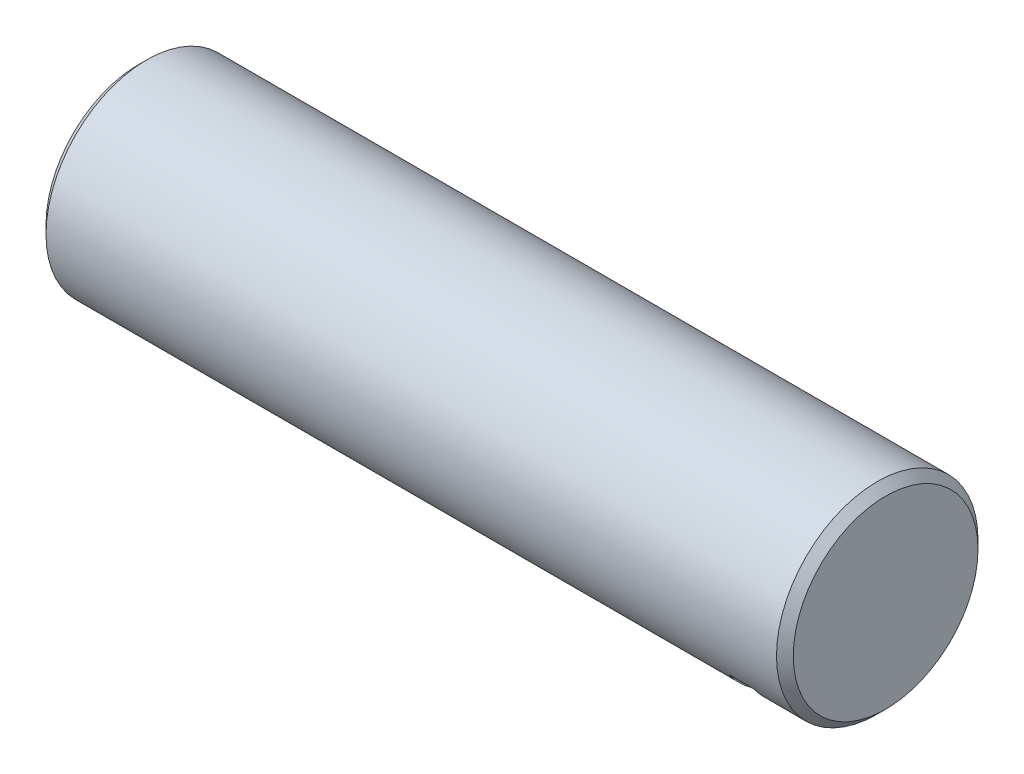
ISO-10303-21;
HEADER;
FILE_DESCRIPTION(('STEP AP214'),'2;1');
FILE_NAME('part.step','',(''),(''),'','','');
FILE_SCHEMA(('AUTOMOTIVE_DESIGN { 1 0 10303 214 1 1 1 1 }'));
ENDSEC;
DATA;
#1=APPLICATION_CONTEXT('core data for automotive mechanical design processes');
#2=APPLICATION_PROTOCOL_DEFINITION('international standard','automotive_design',2000,#1);
#3=PRODUCT_CONTEXT('',#1,'mechanical');
#4=PRODUCT('Part','Part','',(#3));
#5=PRODUCT_RELATED_PRODUCT_CATEGORY('part','',(#4));
#6=PRODUCT_DEFINITION_FORMATION('','',#4);
#7=PRODUCT_DEFINITION_CONTEXT('part definition',#1,'design');
#8=PRODUCT_DEFINITION('design','',#6,#7);
#9=PRODUCT_DEFINITION_SHAPE('','',#8);
#10=(LENGTH_UNIT() NAMED_UNIT(*) SI_UNIT(.MILLI.,.METRE.));
#11=(NAMED_UNIT(*) PLANE_ANGLE_UNIT() SI_UNIT($,.RADIAN.));
#12=(NAMED_UNIT(*) SI_UNIT($,.STERADIAN.) SOLID_ANGLE_UNIT());
#13=UNCERTAINTY_MEASURE_WITH_UNIT(LENGTH_MEASURE(1.E-05),#10,'distance_accuracy_value','');
#14=(GEOMETRIC_REPRESENTATION_CONTEXT(3) GLOBAL_UNCERTAINTY_ASSIGNED_CONTEXT((#13)) GLOBAL_UNIT_ASSIGNED_CONTEXT((#10,
#11,#12)) REPRESENTATION_CONTEXT('',''));
#15=CARTESIAN_POINT('',(0.,0.,0.));
#16=DIRECTION('',(0.,0.,1.));
#17=DIRECTION('',(1.,0.,0.));
#18=AXIS2_PLACEMENT_3D('',#15,#16,#17);
#19=CARTESIAN_POINT('',(17.75,-3.5,-10.));
#20=DIRECTION('',(0.,1.,0.));
#21=DIRECTION('',(0.,0.,1.));
#22=AXIS2_PLACEMENT_3D('',#19,#20,#21);
#23=PLANE('',#22);
#24=DIRECTION('',(1.,0.,0.));
#25=VECTOR('',#24,1.);
#26=CARTESIAN_POINT('',(17.75,-3.5,4.87339717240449));
#27=LINE('',#26,#25);
#28=CARTESIAN_POINT('',(17.75,-3.5,4.87339717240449));
#29=VERTEX_POINT('',#28);
#30=CARTESIAN_POINT('',(19.25,-3.5,4.87339717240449));
#31=VERTEX_POINT('',#30);
#32=EDGE_CURVE('E33',#29,#31,#27,.T.);
#33=ORIENTED_EDGE('',*,*,#32,.F.);
#34=DIRECTION('',(0.,0.,1.));
#35=VECTOR('',#34,1.);
#36=CARTESIAN_POINT('',(17.75,-3.5,-10.));
#37=LINE('',#36,#35);
#38=CARTESIAN_POINT('',(17.75,-3.5,-4.87339717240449));
#39=VERTEX_POINT('',#38);
#40=EDGE_CURVE('E51',#29,#39,#37,.F.);
#41=ORIENTED_EDGE('',*,*,#40,.T.);
#42=DIRECTION('',(1.,0.,0.));
#43=VECTOR('',#42,1.);
#44=CARTESIAN_POINT('',(17.75,-3.5,-4.87339717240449));
#45=LINE('',#44,#43);
#46=CARTESIAN_POINT('',(19.25,-3.5,-4.87339717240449));
#47=VERTEX_POINT('',#46);
#48=EDGE_CURVE('E40',#47,#39,#45,.F.);
#49=ORIENTED_EDGE('',*,*,#48,.F.);
#50=DIRECTION('',(0.,0.,1.));
#51=VECTOR('',#50,1.);
#52=CARTESIAN_POINT('',(19.25,-3.5,-10.));
#53=LINE('',#52,#51);
#54=EDGE_CURVE('E53',#47,#31,#53,.T.);
#55=ORIENTED_EDGE('',*,*,#54,.T.);
#56=EDGE_LOOP('',(#33,#41,#49,#55));
#57=FACE_BOUND('',#56,.T.);
#58=ADVANCED_FACE('F16',(#57),#23,.F.);
#59=CARTESIAN_POINT('',(22.25,6.00000000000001,0.));
#60=DIRECTION('',(-1.,0.,0.));
#61=DIRECTION('',(0.,0.,1.));
#62=AXIS2_PLACEMENT_3D('',#59,#60,#61);
#63=PLANE('',#62);
#64=CARTESIAN_POINT('',(22.2499999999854,0.,0.));
#65=DIRECTION('',(-1.,0.,0.));
#66=DIRECTION('',(0.,0.,1.));
#67=AXIS2_PLACEMENT_3D('',#64,#65,#66);
#68=CIRCLE('',#67,5.49999999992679);
#69=CARTESIAN_POINT('',(22.2499999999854,0.,5.49999999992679));
#70=VERTEX_POINT('',#69);
#71=EDGE_CURVE('E19',#70,#70,#68,.T.);
#72=ORIENTED_EDGE('',*,*,#71,.F.);
#73=EDGE_LOOP('',(#72));
#74=FACE_BOUND('',#73,.T.);
#75=ADVANCED_FACE('F76',(#74),#63,.F.);
#76=CARTESIAN_POINT('',(-22.25,6.,0.));
#77=DIRECTION('',(1.,0.,0.));
#78=DIRECTION('',(0.,0.,-1.));
#79=AXIS2_PLACEMENT_3D('',#76,#77,#78);
#80=PLANE('',#79);
#81=CARTESIAN_POINT('',(-22.2499999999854,0.,0.));
#82=DIRECTION('',(1.,0.,0.));
#83=DIRECTION('',(0.,0.,-1.));
#84=AXIS2_PLACEMENT_3D('',#81,#82,#83);
#85=CIRCLE('',#84,5.49999999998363);
#86=CARTESIAN_POINT('',(-22.2499999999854,0.,-5.49999999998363));
#87=VERTEX_POINT('',#86);
#88=EDGE_CURVE('E56',#87,#87,#85,.T.);
#89=ORIENTED_EDGE('',*,*,#88,.F.);
#90=EDGE_LOOP('',(#89));
#91=FACE_BOUND('',#90,.T.);
#92=ADVANCED_FACE('F78',(#91),#80,.F.);
#93=CARTESIAN_POINT('',(17.75,-3.5,-10.));
#94=DIRECTION('',(-1.,0.,0.));
#95=DIRECTION('',(0.,-1.,0.));
#96=AXIS2_PLACEMENT_3D('',#93,#94,#95);
#97=PLANE('',#96);
#98=CARTESIAN_POINT('',(17.75,0.,0.));
#99=DIRECTION('',(-1.,0.,0.));
#100=DIRECTION('',(0.,0.,1.));
#101=AXIS2_PLACEMENT_3D('',#98,#99,#100);
#102=CIRCLE('',#101,6.);
#103=EDGE_CURVE('E44',#39,#29,#102,.T.);
#104=ORIENTED_EDGE('',*,*,#103,.F.);
#105=ORIENTED_EDGE('',*,*,#40,.F.);
#106=EDGE_LOOP('',(#104,#105));
#107=FACE_BOUND('',#106,.T.);
#108=ADVANCED_FACE('F55',(#107),#97,.F.);
#109=CARTESIAN_POINT('',(19.25,-3.5,-10.));
#110=DIRECTION('',(1.,0.,0.));
#111=DIRECTION('',(0.,1.,0.));
#112=AXIS2_PLACEMENT_3D('',#109,#110,#111);
#113=PLANE('',#112);
#114=CARTESIAN_POINT('',(19.25,0.,0.));
#115=DIRECTION('',(-1.,0.,0.));
#116=DIRECTION('',(0.,0.,1.));
#117=AXIS2_PLACEMENT_3D('',#114,#115,#116);
#118=CIRCLE('',#117,6.);
#119=EDGE_CURVE('E46',#31,#47,#118,.F.);
#120=ORIENTED_EDGE('',*,*,#119,.F.);
#121=ORIENTED_EDGE('',*,*,#54,.F.);
#122=EDGE_LOOP('',(#120,#121));
#123=FACE_BOUND('',#122,.T.);
#124=ADVANCED_FACE('F71',(#123),#113,.F.);
#125=CARTESIAN_POINT('',(21.7499999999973,0.,0.));
#126=DIRECTION('',(-1.,0.,0.));
#127=DIRECTION('',(0.,0.,1.));
#128=AXIS2_PLACEMENT_3D('',#125,#126,#127);
#129=CONICAL_SURFACE('',#128,5.99999999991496,0.785398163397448);
#130=CARTESIAN_POINT('',(21.75,0.,0.));
#131=DIRECTION('',(-1.,0.,0.));
#132=DIRECTION('',(0.,0.,1.));
#133=AXIS2_PLACEMENT_3D('',#130,#131,#132);
#134=CIRCLE('',#133,6.);
#135=CARTESIAN_POINT('',(21.75,0.,6.));
#136=VERTEX_POINT('',#135);
#137=EDGE_CURVE('E25',#136,#136,#134,.T.);
#138=ORIENTED_EDGE('',*,*,#137,.F.);
#139=EDGE_LOOP('',(#138));
#140=FACE_BOUND('',#139,.T.);
#141=ORIENTED_EDGE('',*,*,#71,.T.);
#142=EDGE_LOOP('',(#141));
#143=FACE_BOUND('',#142,.T.);
#144=ADVANCED_FACE('F67',(#140,#143),#129,.T.);
#145=CARTESIAN_POINT('',(-21.7499999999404,0.,0.));
#146=DIRECTION('',(1.,0.,0.));
#147=DIRECTION('',(0.,0.,-1.));
#148=AXIS2_PLACEMENT_3D('',#145,#146,#147);
#149=CONICAL_SURFACE('',#148,6.00000000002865,0.785398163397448);
#150=CARTESIAN_POINT('',(-21.75,0.,0.));
#151=DIRECTION('',(-1.,0.,0.));
#152=DIRECTION('',(0.,0.,1.));
#153=AXIS2_PLACEMENT_3D('',#150,#151,#152);
#154=CIRCLE('',#153,6.);
#155=CARTESIAN_POINT('',(-21.75,0.,6.));
#156=VERTEX_POINT('',#155);
#157=EDGE_CURVE('E11',#156,#156,#154,.F.);
#158=ORIENTED_EDGE('',*,*,#157,.F.);
#159=EDGE_LOOP('',(#158));
#160=FACE_BOUND('',#159,.T.);
#161=ORIENTED_EDGE('',*,*,#88,.T.);
#162=EDGE_LOOP('',(#161));
#163=FACE_BOUND('',#162,.T.);
#164=ADVANCED_FACE('F70',(#160,#163),#149,.T.);
#165=CARTESIAN_POINT('',(-46.8038064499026,0.,0.));
#166=DIRECTION('',(-1.,0.,0.));
#167=DIRECTION('',(0.,0.,1.));
#168=AXIS2_PLACEMENT_3D('',#165,#166,#167);
#169=CYLINDRICAL_SURFACE('',#168,6.);
#170=ORIENTED_EDGE('',*,*,#157,.T.);
#171=EDGE_LOOP('',(#170));
#172=FACE_BOUND('',#171,.T.);
#173=ORIENTED_EDGE('',*,*,#137,.T.);
#174=EDGE_LOOP('',(#173));
#175=FACE_BOUND('',#174,.T.);
#176=ORIENTED_EDGE('',*,*,#32,.T.);
#177=ORIENTED_EDGE('',*,*,#119,.T.);
#178=ORIENTED_EDGE('',*,*,#48,.T.);
#179=ORIENTED_EDGE('',*,*,#103,.T.);
#180=EDGE_LOOP('',(#176,#177,#178,#179));
#181=FACE_BOUND('',#180,.T.);
#182=ADVANCED_FACE('F42',(#172,#175,#181),#169,.T.);
#183=CLOSED_SHELL('',(#58,#75,#92,#108,#124,#144,#164,#182));
#184=MANIFOLD_SOLID_BREP('B1',#183);
#185=ADVANCED_BREP_SHAPE_REPRESENTATION('',(#18,#184),#14);
#186=SHAPE_DEFINITION_REPRESENTATION(#9,#185);
ENDSEC;
END-ISO-10303-21;
